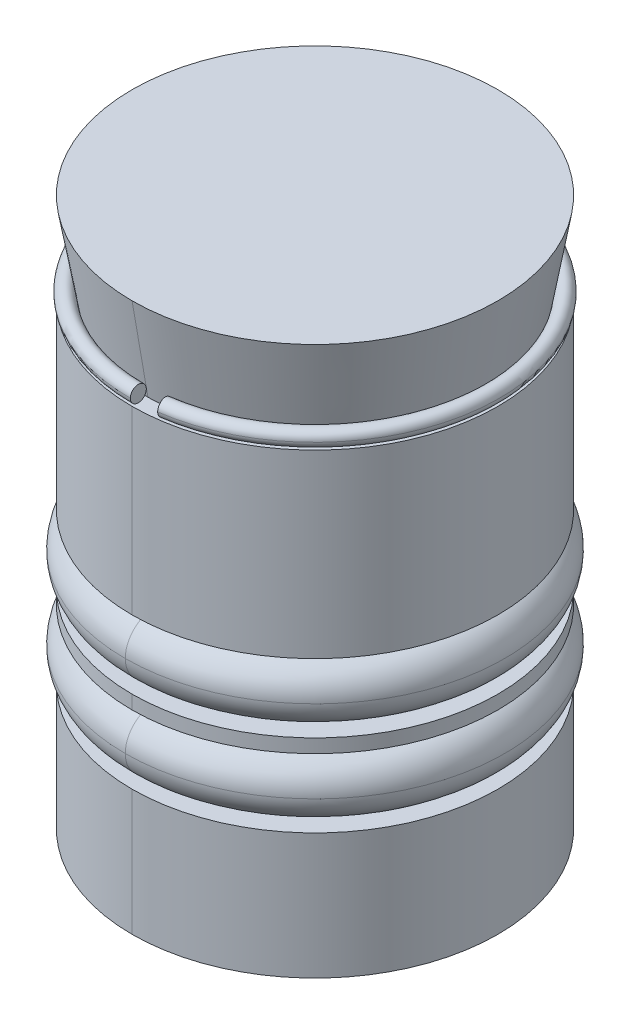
ISO-10303-21;
HEADER;
FILE_DESCRIPTION(('STEP AP214'),'2;1');
FILE_NAME('part.step','',(''),(''),'','','');
FILE_SCHEMA(('AUTOMOTIVE_DESIGN { 1 0 10303 214 1 1 1 1 }'));
ENDSEC;
DATA;
#1=APPLICATION_CONTEXT('core data for automotive mechanical design processes');
#2=APPLICATION_PROTOCOL_DEFINITION('international standard','automotive_design',2000,#1);
#3=PRODUCT_CONTEXT('',#1,'mechanical');
#4=PRODUCT('Part','Part','',(#3));
#5=PRODUCT_RELATED_PRODUCT_CATEGORY('part','',(#4));
#6=PRODUCT_DEFINITION_FORMATION('','',#4);
#7=PRODUCT_DEFINITION_CONTEXT('part definition',#1,'design');
#8=PRODUCT_DEFINITION('design','',#6,#7);
#9=PRODUCT_DEFINITION_SHAPE('','',#8);
#10=(LENGTH_UNIT() NAMED_UNIT(*) SI_UNIT(.MILLI.,.METRE.));
#11=(NAMED_UNIT(*) PLANE_ANGLE_UNIT() SI_UNIT($,.RADIAN.));
#12=(NAMED_UNIT(*) SI_UNIT($,.STERADIAN.) SOLID_ANGLE_UNIT());
#13=UNCERTAINTY_MEASURE_WITH_UNIT(LENGTH_MEASURE(1.E-05),#10,'distance_accuracy_value','');
#14=(GEOMETRIC_REPRESENTATION_CONTEXT(3) GLOBAL_UNCERTAINTY_ASSIGNED_CONTEXT((#13)) GLOBAL_UNIT_ASSIGNED_CONTEXT((#10,
#11,#12)) REPRESENTATION_CONTEXT('',''));
#15=CARTESIAN_POINT('',(0.,0.,0.));
#16=DIRECTION('',(0.,0.,1.));
#17=DIRECTION('',(1.,0.,0.));
#18=AXIS2_PLACEMENT_3D('',#15,#16,#17);
#19=CARTESIAN_POINT('',(0.,5.3,0.));
#20=DIRECTION('',(0.,1.,0.));
#21=DIRECTION('',(0.,0.,1.));
#22=AXIS2_PLACEMENT_3D('',#19,#20,#21);
#23=TOROIDAL_SURFACE('',#22,3.5,0.65);
#24=CARTESIAN_POINT('',(0.,5.3,0.));
#25=DIRECTION('',(0.,1.,0.));
#26=DIRECTION('',(0.,0.,1.));
#27=AXIS2_PLACEMENT_3D('',#24,#25,#26);
#28=CIRCLE('',#27,4.15);
#29=CARTESIAN_POINT('',(0.,5.3,-4.15));
#30=VERTEX_POINT('',#29);
#31=CARTESIAN_POINT('',(0.,5.3,4.15));
#32=VERTEX_POINT('',#31);
#33=EDGE_CURVE('P0_E68',#30,#32,#28,.T.);
#34=ORIENTED_EDGE('',*,*,#33,.F.);
#35=CARTESIAN_POINT('',(0.,5.3,-3.5));
#36=DIRECTION('',(1.,0.,0.));
#37=DIRECTION('',(0.,0.,-1.));
#38=AXIS2_PLACEMENT_3D('',#35,#36,#37);
#39=CIRCLE('',#38,0.65);
#40=CARTESIAN_POINT('',(0.,5.3,-2.85));
#41=VERTEX_POINT('',#40);
#42=EDGE_CURVE('P0_E11',#41,#30,#39,.T.);
#43=ORIENTED_EDGE('',*,*,#42,.F.);
#44=CARTESIAN_POINT('',(0.,5.3,0.));
#45=DIRECTION('',(0.,1.,0.));
#46=DIRECTION('',(0.,0.,1.));
#47=AXIS2_PLACEMENT_3D('',#44,#45,#46);
#48=CIRCLE('',#47,2.85);
#49=CARTESIAN_POINT('',(0.,5.3,2.85));
#50=VERTEX_POINT('',#49);
#51=EDGE_CURVE('P0_E67',#41,#50,#48,.T.);
#52=ORIENTED_EDGE('',*,*,#51,.T.);
#53=CARTESIAN_POINT('',(0.,5.3,3.5));
#54=DIRECTION('',(-1.,0.,0.));
#55=DIRECTION('',(0.,0.,1.));
#56=AXIS2_PLACEMENT_3D('',#53,#54,#55);
#57=CIRCLE('',#56,0.65);
#58=EDGE_CURVE('P0_E27',#50,#32,#57,.T.);
#59=ORIENTED_EDGE('',*,*,#58,.T.);
#60=EDGE_LOOP('',(#34,#43,#52,#59));
#61=FACE_BOUND('',#60,.T.);
#62=ADVANCED_FACE('P0_F16',(#61),#23,.T.);
#63=CARTESIAN_POINT('',(0.,5.3,0.));
#64=DIRECTION('',(0.,1.,0.));
#65=DIRECTION('',(0.,0.,1.));
#66=AXIS2_PLACEMENT_3D('',#63,#64,#65);
#67=TOROIDAL_SURFACE('',#66,3.5,0.65);
#68=CARTESIAN_POINT('',(0.,5.3,0.));
#69=DIRECTION('',(0.,1.,0.));
#70=DIRECTION('',(0.,0.,1.));
#71=AXIS2_PLACEMENT_3D('',#68,#69,#70);
#72=CIRCLE('',#71,4.15);
#73=EDGE_CURVE('P0_E52',#32,#30,#72,.T.);
#74=ORIENTED_EDGE('',*,*,#73,.F.);
#75=ORIENTED_EDGE('',*,*,#58,.F.);
#76=CARTESIAN_POINT('',(0.,5.3,0.));
#77=DIRECTION('',(0.,1.,0.));
#78=DIRECTION('',(0.,0.,1.));
#79=AXIS2_PLACEMENT_3D('',#76,#77,#78);
#80=CIRCLE('',#79,2.85);
#81=EDGE_CURVE('P0_E20',#50,#41,#80,.T.);
#82=ORIENTED_EDGE('',*,*,#81,.T.);
#83=ORIENTED_EDGE('',*,*,#42,.T.);
#84=EDGE_LOOP('',(#74,#75,#82,#83));
#85=FACE_BOUND('',#84,.T.);
#86=ADVANCED_FACE('P0_F51',(#85),#67,.T.);
#87=CARTESIAN_POINT('',(0.,5.3,0.));
#88=DIRECTION('',(0.,1.,0.));
#89=DIRECTION('',(0.,0.,1.));
#90=AXIS2_PLACEMENT_3D('',#87,#88,#89);
#91=TOROIDAL_SURFACE('',#90,3.5,0.65);
#92=CARTESIAN_POINT('',(0.,5.3,3.5));
#93=DIRECTION('',(-1.,0.,0.));
#94=DIRECTION('',(0.,0.,1.));
#95=AXIS2_PLACEMENT_3D('',#92,#93,#94);
#96=CIRCLE('',#95,0.65);
#97=EDGE_CURVE('P0_E64',#32,#50,#96,.T.);
#98=ORIENTED_EDGE('',*,*,#97,.F.);
#99=ORIENTED_EDGE('',*,*,#73,.T.);
#100=CARTESIAN_POINT('',(0.,5.3,-3.5));
#101=DIRECTION('',(1.,0.,0.));
#102=DIRECTION('',(0.,0.,-1.));
#103=AXIS2_PLACEMENT_3D('',#100,#101,#102);
#104=CIRCLE('',#103,0.65);
#105=EDGE_CURVE('P0_E62',#30,#41,#104,.T.);
#106=ORIENTED_EDGE('',*,*,#105,.T.);
#107=ORIENTED_EDGE('',*,*,#81,.F.);
#108=EDGE_LOOP('',(#98,#99,#106,#107));
#109=FACE_BOUND('',#108,.T.);
#110=ADVANCED_FACE('P0_F60',(#109),#91,.T.);
#111=CARTESIAN_POINT('',(0.,5.3,0.));
#112=DIRECTION('',(0.,1.,0.));
#113=DIRECTION('',(0.,0.,1.));
#114=AXIS2_PLACEMENT_3D('',#111,#112,#113);
#115=TOROIDAL_SURFACE('',#114,3.5,0.65);
#116=ORIENTED_EDGE('',*,*,#105,.F.);
#117=ORIENTED_EDGE('',*,*,#33,.T.);
#118=ORIENTED_EDGE('',*,*,#97,.T.);
#119=ORIENTED_EDGE('',*,*,#51,.F.);
#120=EDGE_LOOP('',(#116,#117,#118,#119));
#121=FACE_BOUND('',#120,.T.);
#122=ADVANCED_FACE('P0_F18',(#121),#115,.T.);
#123=CLOSED_SHELL('',(#62,#86,#110,#122));
#124=MANIFOLD_SOLID_BREP('P0_B1',#123);
#125=CARTESIAN_POINT('',(0.535424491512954,10.175,3.82690795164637));
#126=DIRECTION('',(0.990353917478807,0.,-0.138560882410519));
#127=DIRECTION('',(0.,-1.,0.));
#128=AXIS2_PLACEMENT_3D('',#125,#126,#127);
#129=PLANE('',#128);
#130=CARTESIAN_POINT('',(0.535424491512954,10.175,3.82690795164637));
#131=DIRECTION('',(0.990353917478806,0.,-0.138560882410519));
#132=DIRECTION('',(-0.138560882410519,0.,-0.990353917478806));
#133=AXIS2_PLACEMENT_3D('',#130,#131,#132);
#134=CIRCLE('',#133,0.175);
#135=CARTESIAN_POINT('',(0.511176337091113,10.175,3.65359601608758));
#136=VERTEX_POINT('',#135);
#137=CARTESIAN_POINT('',(0.559672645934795,10.175,4.00021988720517));
#138=VERTEX_POINT('',#137);
#139=EDGE_CURVE('P1_E66',#136,#138,#134,.T.);
#140=ORIENTED_EDGE('',*,*,#139,.F.);
#141=CARTESIAN_POINT('',(0.535424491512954,10.175,3.82690795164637));
#142=DIRECTION('',(0.990353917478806,0.,-0.138560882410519));
#143=DIRECTION('',(-0.138560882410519,0.,-0.990353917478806));
#144=AXIS2_PLACEMENT_3D('',#141,#142,#143);
#145=CIRCLE('',#144,0.175);
#146=EDGE_CURVE('P1_E26',#138,#136,#145,.T.);
#147=ORIENTED_EDGE('',*,*,#146,.F.);
#148=EDGE_LOOP('',(#140,#147));
#149=FACE_BOUND('',#148,.T.);
#150=ADVANCED_FACE('P1_F16',(#149),#129,.F.);
#151=CARTESIAN_POINT('',(0.,10.175,3.86418217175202));
#152=DIRECTION('',(1.,0.,0.));
#153=DIRECTION('',(0.,1.,0.));
#154=AXIS2_PLACEMENT_3D('',#151,#152,#153);
#155=PLANE('',#154);
#156=CARTESIAN_POINT('',(0.,10.175,3.86418217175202));
#157=DIRECTION('',(1.,0.,0.));
#158=DIRECTION('',(0.,0.,-1.));
#159=AXIS2_PLACEMENT_3D('',#156,#157,#158);
#160=CIRCLE('',#159,0.175);
#161=CARTESIAN_POINT('',(0.,10.175,3.68918217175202));
#162=VERTEX_POINT('',#161);
#163=CARTESIAN_POINT('',(0.,10.175,4.03918217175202));
#164=VERTEX_POINT('',#163);
#165=EDGE_CURVE('P1_E20',#162,#164,#160,.T.);
#166=ORIENTED_EDGE('',*,*,#165,.T.);
#167=CARTESIAN_POINT('',(0.,10.175,3.86418217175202));
#168=DIRECTION('',(1.,0.,0.));
#169=DIRECTION('',(0.,0.,-1.));
#170=AXIS2_PLACEMENT_3D('',#167,#168,#169);
#171=CIRCLE('',#170,0.175);
#172=EDGE_CURVE('P1_E11',#164,#162,#171,.T.);
#173=ORIENTED_EDGE('',*,*,#172,.T.);
#174=EDGE_LOOP('',(#166,#173));
#175=FACE_BOUND('',#174,.T.);
#176=ADVANCED_FACE('P1_F18',(#175),#155,.T.);
#177=CARTESIAN_POINT('',(0.,10.175,0.));
#178=DIRECTION('',(0.,1.,0.));
#179=DIRECTION('',(0.,0.,1.));
#180=AXIS2_PLACEMENT_3D('',#177,#178,#179);
#181=TOROIDAL_SURFACE('',#180,3.86418217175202,0.175);
#182=CARTESIAN_POINT('',(0.,10.175,0.));
#183=DIRECTION('',(0.,1.,0.));
#184=DIRECTION('',(0.,0.,1.));
#185=AXIS2_PLACEMENT_3D('',#182,#183,#184);
#186=CIRCLE('',#185,4.03918217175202);
#187=EDGE_CURVE('P1_E58',#138,#164,#186,.T.);
#188=ORIENTED_EDGE('',*,*,#187,.F.);
#189=ORIENTED_EDGE('',*,*,#146,.T.);
#190=CARTESIAN_POINT('',(0.,10.175,0.));
#191=DIRECTION('',(0.,1.,0.));
#192=DIRECTION('',(0.,0.,1.));
#193=AXIS2_PLACEMENT_3D('',#190,#191,#192);
#194=CIRCLE('',#193,3.68918217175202);
#195=EDGE_CURVE('P1_E55',#136,#162,#194,.T.);
#196=ORIENTED_EDGE('',*,*,#195,.T.);
#197=ORIENTED_EDGE('',*,*,#172,.F.);
#198=EDGE_LOOP('',(#188,#189,#196,#197));
#199=FACE_BOUND('',#198,.T.);
#200=ADVANCED_FACE('P1_F54',(#199),#181,.T.);
#201=CARTESIAN_POINT('',(0.,10.175,0.));
#202=DIRECTION('',(0.,1.,0.));
#203=DIRECTION('',(0.,0.,1.));
#204=AXIS2_PLACEMENT_3D('',#201,#202,#203);
#205=TOROIDAL_SURFACE('',#204,3.86418217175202,0.175);
#206=ORIENTED_EDGE('',*,*,#139,.T.);
#207=ORIENTED_EDGE('',*,*,#187,.T.);
#208=ORIENTED_EDGE('',*,*,#165,.F.);
#209=ORIENTED_EDGE('',*,*,#195,.F.);
#210=EDGE_LOOP('',(#206,#207,#208,#209));
#211=FACE_BOUND('',#210,.T.);
#212=ADVANCED_FACE('P1_F65',(#211),#205,.T.);
#213=CLOSED_SHELL('',(#150,#176,#200,#212));
#214=MANIFOLD_SOLID_BREP('P1_B1',#213);
#215=CARTESIAN_POINT('',(0.,12.,0.));
#216=DIRECTION('',(0.,-1.,0.));
#217=DIRECTION('',(0.,0.,-1.));
#218=AXIS2_PLACEMENT_3D('',#215,#216,#217);
#219=PLANE('',#218);
#220=CARTESIAN_POINT('',(0.,12.,0.));
#221=DIRECTION('',(0.,1.,0.));
#222=DIRECTION('',(0.,0.,1.));
#223=AXIS2_PLACEMENT_3D('',#220,#221,#222);
#224=CIRCLE('',#223,4.);
#225=CARTESIAN_POINT('',(0.,12.,4.));
#226=VERTEX_POINT('',#225);
#227=CARTESIAN_POINT('',(0.,12.,-4.));
#228=VERTEX_POINT('',#227);
#229=EDGE_CURVE('P2_E228',#226,#228,#224,.T.);
#230=ORIENTED_EDGE('',*,*,#229,.T.);
#231=CARTESIAN_POINT('',(0.,12.,0.));
#232=DIRECTION('',(0.,1.,0.));
#233=DIRECTION('',(0.,0.,1.));
#234=AXIS2_PLACEMENT_3D('',#231,#232,#233);
#235=CIRCLE('',#234,4.);
#236=EDGE_CURVE('P2_E11',#228,#226,#235,.T.);
#237=ORIENTED_EDGE('',*,*,#236,.T.);
#238=EDGE_LOOP('',(#230,#237));
#239=FACE_BOUND('',#238,.T.);
#240=ADVANCED_FACE('P2_F16',(#239),#219,.F.);
#241=CARTESIAN_POINT('',(0.,10.,0.));
#242=DIRECTION('',(0.,1.,0.));
#243=DIRECTION('',(0.,0.,1.));
#244=AXIS2_PLACEMENT_3D('',#241,#242,#243);
#245=CONICAL_SURFACE('',#244,3.65371595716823,0.171442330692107);
#246=DIRECTION('',(0.,0.985339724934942,-0.17060371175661));
#247=VECTOR('',#246,1.);
#248=CARTESIAN_POINT('',(0.,10.,-3.65371595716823));
#249=LINE('',#248,#247);
#250=CARTESIAN_POINT('',(0.,10.,-3.65371595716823));
#251=VERTEX_POINT('',#250);
#252=EDGE_CURVE('P2_E233',#251,#228,#249,.T.);
#253=ORIENTED_EDGE('',*,*,#252,.F.);
#254=CARTESIAN_POINT('',(0.,10.,0.));
#255=DIRECTION('',(0.,1.,0.));
#256=DIRECTION('',(0.,0.,1.));
#257=AXIS2_PLACEMENT_3D('',#254,#255,#256);
#258=CIRCLE('',#257,3.65371595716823);
#259=CARTESIAN_POINT('',(0.,10.,3.65371595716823));
#260=VERTEX_POINT('',#259);
#261=EDGE_CURVE('P2_E27',#251,#260,#258,.T.);
#262=ORIENTED_EDGE('',*,*,#261,.T.);
#263=DIRECTION('',(0.,0.985339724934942,0.17060371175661));
#264=VECTOR('',#263,1.);
#265=CARTESIAN_POINT('',(0.,10.,3.65371595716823));
#266=LINE('',#265,#264);
#267=EDGE_CURVE('P2_E224',#260,#226,#266,.T.);
#268=ORIENTED_EDGE('',*,*,#267,.T.);
#269=ORIENTED_EDGE('',*,*,#236,.F.);
#270=EDGE_LOOP('',(#253,#262,#268,#269));
#271=FACE_BOUND('',#270,.T.);
#272=ADVANCED_FACE('P2_F426',(#271),#245,.T.);
#273=CARTESIAN_POINT('',(0.,10.,-4.));
#274=DIRECTION('',(0.,-1.,0.));
#275=DIRECTION('',(0.,0.,-1.));
#276=AXIS2_PLACEMENT_3D('',#273,#274,#275);
#277=PLANE('',#276);
#278=CARTESIAN_POINT('',(0.,10.,0.));
#279=DIRECTION('',(0.,1.,0.));
#280=DIRECTION('',(0.,0.,1.));
#281=AXIS2_PLACEMENT_3D('',#278,#279,#280);
#282=CIRCLE('',#281,3.65371595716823);
#283=EDGE_CURVE('P2_E211',#260,#251,#282,.T.);
#284=ORIENTED_EDGE('',*,*,#283,.F.);
#285=ORIENTED_EDGE('',*,*,#261,.F.);
#286=EDGE_LOOP('',(#284,#285));
#287=FACE_BOUND('',#286,.T.);
#288=CARTESIAN_POINT('',(0.,10.,0.));
#289=DIRECTION('',(0.,1.,0.));
#290=DIRECTION('',(0.,0.,1.));
#291=AXIS2_PLACEMENT_3D('',#288,#289,#290);
#292=CIRCLE('',#291,4.);
#293=CARTESIAN_POINT('',(0.,10.,4.));
#294=VERTEX_POINT('',#293);
#295=CARTESIAN_POINT('',(0.,10.,-4.));
#296=VERTEX_POINT('',#295);
#297=EDGE_CURVE('P2_E277',#294,#296,#292,.T.);
#298=ORIENTED_EDGE('',*,*,#297,.T.);
#299=CARTESIAN_POINT('',(0.,10.,0.));
#300=DIRECTION('',(0.,1.,0.));
#301=DIRECTION('',(0.,0.,1.));
#302=AXIS2_PLACEMENT_3D('',#299,#300,#301);
#303=CIRCLE('',#302,4.);
#304=EDGE_CURVE('P2_E195',#296,#294,#303,.T.);
#305=ORIENTED_EDGE('',*,*,#304,.T.);
#306=EDGE_LOOP('',(#298,#305));
#307=FACE_BOUND('',#306,.T.);
#308=ADVANCED_FACE('P2_F431',(#287,#307),#277,.F.);
#309=CARTESIAN_POINT('',(0.,12.,0.));
#310=DIRECTION('',(0.,1.,0.));
#311=DIRECTION('',(0.,0.,1.));
#312=AXIS2_PLACEMENT_3D('',#309,#310,#311);
#313=CYLINDRICAL_SURFACE('',#312,4.);
#314=DIRECTION('',(0.,1.,0.));
#315=VECTOR('',#314,1.);
#316=CARTESIAN_POINT('',(0.,12.,-4.));
#317=LINE('',#316,#315);
#318=CARTESIAN_POINT('',(0.,6.05,-4.));
#319=VERTEX_POINT('',#318);
#320=EDGE_CURVE('P2_E269',#319,#296,#317,.T.);
#321=ORIENTED_EDGE('',*,*,#320,.F.);
#322=CARTESIAN_POINT('',(0.,6.05,0.));
#323=DIRECTION('',(0.,1.,0.));
#324=DIRECTION('',(0.,0.,1.));
#325=AXIS2_PLACEMENT_3D('',#322,#323,#324);
#326=CIRCLE('',#325,4.);
#327=CARTESIAN_POINT('',(0.,6.05,4.));
#328=VERTEX_POINT('',#327);
#329=EDGE_CURVE('P2_E197',#319,#328,#326,.T.);
#330=ORIENTED_EDGE('',*,*,#329,.T.);
#331=DIRECTION('',(0.,1.,0.));
#332=VECTOR('',#331,1.);
#333=CARTESIAN_POINT('',(0.,12.,4.));
#334=LINE('',#333,#332);
#335=EDGE_CURVE('P2_E280',#328,#294,#334,.T.);
#336=ORIENTED_EDGE('',*,*,#335,.T.);
#337=ORIENTED_EDGE('',*,*,#304,.F.);
#338=EDGE_LOOP('',(#321,#330,#336,#337));
#339=FACE_BOUND('',#338,.T.);
#340=ADVANCED_FACE('P2_F451',(#339),#313,.T.);
#341=CARTESIAN_POINT('',(0.,6.05,-3.5));
#342=DIRECTION('',(0.,1.,0.));
#343=DIRECTION('',(0.,0.,-1.));
#344=AXIS2_PLACEMENT_3D('',#341,#342,#343);
#345=PLANE('',#344);
#346=CARTESIAN_POINT('',(0.,6.05,0.));
#347=DIRECTION('',(0.,1.,0.));
#348=DIRECTION('',(0.,0.,1.));
#349=AXIS2_PLACEMENT_3D('',#346,#347,#348);
#350=CIRCLE('',#349,3.5);
#351=CARTESIAN_POINT('',(0.,6.05,3.5));
#352=VERTEX_POINT('',#351);
#353=CARTESIAN_POINT('',(0.,6.05,-3.5));
#354=VERTEX_POINT('',#353);
#355=EDGE_CURVE('P2_E190',#352,#354,#350,.T.);
#356=ORIENTED_EDGE('',*,*,#355,.T.);
#357=CARTESIAN_POINT('',(0.,6.05,0.));
#358=DIRECTION('',(0.,1.,0.));
#359=DIRECTION('',(0.,0.,1.));
#360=AXIS2_PLACEMENT_3D('',#357,#358,#359);
#361=CIRCLE('',#360,3.5);
#362=EDGE_CURVE('P2_E208',#354,#352,#361,.T.);
#363=ORIENTED_EDGE('',*,*,#362,.T.);
#364=EDGE_LOOP('',(#356,#363));
#365=FACE_BOUND('',#364,.T.);
#366=CARTESIAN_POINT('',(0.,6.05,0.));
#367=DIRECTION('',(0.,1.,0.));
#368=DIRECTION('',(0.,0.,1.));
#369=AXIS2_PLACEMENT_3D('',#366,#367,#368);
#370=CIRCLE('',#369,4.);
#371=EDGE_CURVE('P2_E227',#328,#319,#370,.T.);
#372=ORIENTED_EDGE('',*,*,#371,.F.);
#373=ORIENTED_EDGE('',*,*,#329,.F.);
#374=EDGE_LOOP('',(#372,#373));
#375=FACE_BOUND('',#374,.T.);
#376=ADVANCED_FACE('P2_F456',(#365,#375),#345,.F.);
#377=CARTESIAN_POINT('',(0.,5.3,0.));
#378=DIRECTION('',(0.,1.,0.));
#379=DIRECTION('',(0.,0.,1.));
#380=AXIS2_PLACEMENT_3D('',#377,#378,#379);
#381=TOROIDAL_SURFACE('',#380,3.5,0.75);
#382=CARTESIAN_POINT('',(0.,5.3,0.));
#383=DIRECTION('',(0.,1.,0.));
#384=DIRECTION('',(0.,0.,1.));
#385=AXIS2_PLACEMENT_3D('',#382,#383,#384);
#386=CIRCLE('',#385,2.75);
#387=CARTESIAN_POINT('',(0.,5.3,2.75));
#388=VERTEX_POINT('',#387);
#389=CARTESIAN_POINT('',(0.,5.3,-2.75));
#390=VERTEX_POINT('',#389);
#391=EDGE_CURVE('P2_E198',#388,#390,#386,.T.);
#392=ORIENTED_EDGE('',*,*,#391,.F.);
#393=CARTESIAN_POINT('',(0.,5.3,3.5));
#394=DIRECTION('',(-1.,0.,0.));
#395=DIRECTION('',(0.,0.,1.));
#396=AXIS2_PLACEMENT_3D('',#393,#394,#395);
#397=CIRCLE('',#396,0.75);
#398=CARTESIAN_POINT('',(0.,4.55,3.5));
#399=VERTEX_POINT('',#398);
#400=EDGE_CURVE('P2_E258',#388,#399,#397,.T.);
#401=ORIENTED_EDGE('',*,*,#400,.T.);
#402=CARTESIAN_POINT('',(0.,4.55,0.));
#403=DIRECTION('',(0.,1.,0.));
#404=DIRECTION('',(0.,0.,1.));
#405=AXIS2_PLACEMENT_3D('',#402,#403,#404);
#406=CIRCLE('',#405,3.5);
#407=CARTESIAN_POINT('',(0.,4.55,-3.5));
#408=VERTEX_POINT('',#407);
#409=EDGE_CURVE('P2_E273',#399,#408,#406,.T.);
#410=ORIENTED_EDGE('',*,*,#409,.T.);
#411=CARTESIAN_POINT('',(0.,5.3,-3.5));
#412=DIRECTION('',(1.,0.,0.));
#413=DIRECTION('',(0.,0.,-1.));
#414=AXIS2_PLACEMENT_3D('',#411,#412,#413);
#415=CIRCLE('',#414,0.75);
#416=EDGE_CURVE('P2_E295',#390,#408,#415,.T.);
#417=ORIENTED_EDGE('',*,*,#416,.F.);
#418=EDGE_LOOP('',(#392,#401,#410,#417));
#419=FACE_BOUND('',#418,.T.);
#420=ADVANCED_FACE('P2_F416',(#419),#381,.F.);
#421=CARTESIAN_POINT('',(0.,4.55,-3.5));
#422=DIRECTION('',(0.,-1.,0.));
#423=DIRECTION('',(0.,0.,-1.));
#424=AXIS2_PLACEMENT_3D('',#421,#422,#423);
#425=PLANE('',#424);
#426=ORIENTED_EDGE('',*,*,#409,.F.);
#427=CARTESIAN_POINT('',(0.,4.55,0.));
#428=DIRECTION('',(0.,1.,0.));
#429=DIRECTION('',(0.,0.,1.));
#430=AXIS2_PLACEMENT_3D('',#427,#428,#429);
#431=CIRCLE('',#430,3.5);
#432=EDGE_CURVE('P2_E262',#408,#399,#431,.T.);
#433=ORIENTED_EDGE('',*,*,#432,.F.);
#434=EDGE_LOOP('',(#426,#433));
#435=FACE_BOUND('',#434,.T.);
#436=CARTESIAN_POINT('',(0.,4.55,0.));
#437=DIRECTION('',(0.,1.,0.));
#438=DIRECTION('',(0.,0.,1.));
#439=AXIS2_PLACEMENT_3D('',#436,#437,#438);
#440=CIRCLE('',#439,4.);
#441=CARTESIAN_POINT('',(0.,4.55,4.));
#442=VERTEX_POINT('',#441);
#443=CARTESIAN_POINT('',(0.,4.55,-4.));
#444=VERTEX_POINT('',#443);
#445=EDGE_CURVE('P2_E212',#442,#444,#440,.T.);
#446=ORIENTED_EDGE('',*,*,#445,.T.);
#447=CARTESIAN_POINT('',(0.,4.55,0.));
#448=DIRECTION('',(0.,1.,0.));
#449=DIRECTION('',(0.,0.,1.));
#450=AXIS2_PLACEMENT_3D('',#447,#448,#449);
#451=CIRCLE('',#450,4.);
#452=EDGE_CURVE('P2_E20',#444,#442,#451,.T.);
#453=ORIENTED_EDGE('',*,*,#452,.T.);
#454=EDGE_LOOP('',(#446,#453));
#455=FACE_BOUND('',#454,.T.);
#456=ADVANCED_FACE('P2_F410',(#435,#455),#425,.F.);
#457=CARTESIAN_POINT('',(0.,12.,0.));
#458=DIRECTION('',(0.,1.,0.));
#459=DIRECTION('',(0.,0.,1.));
#460=AXIS2_PLACEMENT_3D('',#457,#458,#459);
#461=CYLINDRICAL_SURFACE('',#460,4.);
#462=DIRECTION('',(0.,1.,0.));
#463=VECTOR('',#462,1.);
#464=CARTESIAN_POINT('',(0.,12.,-4.));
#465=LINE('',#464,#463);
#466=CARTESIAN_POINT('',(0.,4.25,-4.));
#467=VERTEX_POINT('',#466);
#468=EDGE_CURVE('P2_E216',#467,#444,#465,.T.);
#469=ORIENTED_EDGE('',*,*,#468,.F.);
#470=CARTESIAN_POINT('',(0.,4.25,0.));
#471=DIRECTION('',(0.,1.,0.));
#472=DIRECTION('',(0.,0.,1.));
#473=AXIS2_PLACEMENT_3D('',#470,#471,#472);
#474=CIRCLE('',#473,4.);
#475=CARTESIAN_POINT('',(0.,4.25,4.));
#476=VERTEX_POINT('',#475);
#477=EDGE_CURVE('P2_E274',#467,#476,#474,.T.);
#478=ORIENTED_EDGE('',*,*,#477,.T.);
#479=DIRECTION('',(0.,1.,0.));
#480=VECTOR('',#479,1.);
#481=CARTESIAN_POINT('',(0.,12.,4.));
#482=LINE('',#481,#480);
#483=EDGE_CURVE('P2_E161',#476,#442,#482,.T.);
#484=ORIENTED_EDGE('',*,*,#483,.T.);
#485=ORIENTED_EDGE('',*,*,#452,.F.);
#486=EDGE_LOOP('',(#469,#478,#484,#485));
#487=FACE_BOUND('',#486,.T.);
#488=ADVANCED_FACE('P2_F415',(#487),#461,.T.);
#489=CARTESIAN_POINT('',(0.,4.25,-3.5));
#490=DIRECTION('',(0.,1.,0.));
#491=DIRECTION('',(0.,0.,-1.));
#492=AXIS2_PLACEMENT_3D('',#489,#490,#491);
#493=PLANE('',#492);
#494=CARTESIAN_POINT('',(0.,4.25,0.));
#495=DIRECTION('',(0.,1.,0.));
#496=DIRECTION('',(0.,0.,1.));
#497=AXIS2_PLACEMENT_3D('',#494,#495,#496);
#498=CIRCLE('',#497,3.5);
#499=CARTESIAN_POINT('',(0.,4.25,3.5));
#500=VERTEX_POINT('',#499);
#501=CARTESIAN_POINT('',(0.,4.25,-3.5));
#502=VERTEX_POINT('',#501);
#503=EDGE_CURVE('P2_E172',#500,#502,#498,.T.);
#504=ORIENTED_EDGE('',*,*,#503,.T.);
#505=CARTESIAN_POINT('',(0.,4.25,0.));
#506=DIRECTION('',(0.,1.,0.));
#507=DIRECTION('',(0.,0.,1.));
#508=AXIS2_PLACEMENT_3D('',#505,#506,#507);
#509=CIRCLE('',#508,3.5);
#510=EDGE_CURVE('P2_E171',#502,#500,#509,.T.);
#511=ORIENTED_EDGE('',*,*,#510,.T.);
#512=EDGE_LOOP('',(#504,#511));
#513=FACE_BOUND('',#512,.T.);
#514=CARTESIAN_POINT('',(0.,4.25,0.));
#515=DIRECTION('',(0.,1.,0.));
#516=DIRECTION('',(0.,0.,1.));
#517=AXIS2_PLACEMENT_3D('',#514,#515,#516);
#518=CIRCLE('',#517,4.);
#519=EDGE_CURVE('P2_E194',#476,#467,#518,.T.);
#520=ORIENTED_EDGE('',*,*,#519,.F.);
#521=ORIENTED_EDGE('',*,*,#477,.F.);
#522=EDGE_LOOP('',(#520,#521));
#523=FACE_BOUND('',#522,.T.);
#524=ADVANCED_FACE('P2_F362',(#513,#523),#493,.F.);
#525=CARTESIAN_POINT('',(0.,3.5,0.));
#526=DIRECTION('',(0.,1.,0.));
#527=DIRECTION('',(0.,0.,1.));
#528=AXIS2_PLACEMENT_3D('',#525,#526,#527);
#529=TOROIDAL_SURFACE('',#528,3.5,0.75);
#530=CARTESIAN_POINT('',(0.,3.5,0.));
#531=DIRECTION('',(0.,1.,0.));
#532=DIRECTION('',(0.,0.,1.));
#533=AXIS2_PLACEMENT_3D('',#530,#531,#532);
#534=CIRCLE('',#533,2.75);
#535=CARTESIAN_POINT('',(0.,3.5,2.75));
#536=VERTEX_POINT('',#535);
#537=CARTESIAN_POINT('',(0.,3.5,-2.75));
#538=VERTEX_POINT('',#537);
#539=EDGE_CURVE('P2_E153',#536,#538,#534,.T.);
#540=ORIENTED_EDGE('',*,*,#539,.F.);
#541=CARTESIAN_POINT('',(0.,3.5,3.5));
#542=DIRECTION('',(-1.,0.,0.));
#543=DIRECTION('',(0.,0.,1.));
#544=AXIS2_PLACEMENT_3D('',#541,#542,#543);
#545=CIRCLE('',#544,0.75);
#546=CARTESIAN_POINT('',(0.,2.75,3.5));
#547=VERTEX_POINT('',#546);
#548=EDGE_CURVE('P2_E167',#536,#547,#545,.T.);
#549=ORIENTED_EDGE('',*,*,#548,.T.);
#550=CARTESIAN_POINT('',(0.,2.75,0.));
#551=DIRECTION('',(0.,1.,0.));
#552=DIRECTION('',(0.,0.,1.));
#553=AXIS2_PLACEMENT_3D('',#550,#551,#552);
#554=CIRCLE('',#553,3.5);
#555=CARTESIAN_POINT('',(0.,2.75,-3.5));
#556=VERTEX_POINT('',#555);
#557=EDGE_CURVE('P2_E155',#547,#556,#554,.T.);
#558=ORIENTED_EDGE('',*,*,#557,.T.);
#559=CARTESIAN_POINT('',(0.,3.5,-3.5));
#560=DIRECTION('',(1.,0.,0.));
#561=DIRECTION('',(0.,0.,-1.));
#562=AXIS2_PLACEMENT_3D('',#559,#560,#561);
#563=CIRCLE('',#562,0.75);
#564=EDGE_CURVE('P2_E148',#538,#556,#563,.T.);
#565=ORIENTED_EDGE('',*,*,#564,.F.);
#566=EDGE_LOOP('',(#540,#549,#558,#565));
#567=FACE_BOUND('',#566,.T.);
#568=ADVANCED_FACE('P2_F150',(#567),#529,.F.);
#569=CARTESIAN_POINT('',(0.,2.75,-3.5));
#570=DIRECTION('',(0.,-1.,0.));
#571=DIRECTION('',(0.,0.,-1.));
#572=AXIS2_PLACEMENT_3D('',#569,#570,#571);
#573=PLANE('',#572);
#574=ORIENTED_EDGE('',*,*,#557,.F.);
#575=CARTESIAN_POINT('',(0.,2.75,0.));
#576=DIRECTION('',(0.,1.,0.));
#577=DIRECTION('',(0.,0.,1.));
#578=AXIS2_PLACEMENT_3D('',#575,#576,#577);
#579=CIRCLE('',#578,3.5);
#580=EDGE_CURVE('P2_E160',#556,#547,#579,.T.);
#581=ORIENTED_EDGE('',*,*,#580,.F.);
#582=EDGE_LOOP('',(#574,#581));
#583=FACE_BOUND('',#582,.T.);
#584=CARTESIAN_POINT('',(0.,2.75,0.));
#585=DIRECTION('',(0.,1.,0.));
#586=DIRECTION('',(0.,0.,1.));
#587=AXIS2_PLACEMENT_3D('',#584,#585,#586);
#588=CIRCLE('',#587,4.);
#589=CARTESIAN_POINT('',(0.,2.75,4.));
#590=VERTEX_POINT('',#589);
#591=CARTESIAN_POINT('',(0.,2.75,-4.));
#592=VERTEX_POINT('',#591);
#593=EDGE_CURVE('P2_E219',#590,#592,#588,.T.);
#594=ORIENTED_EDGE('',*,*,#593,.T.);
#595=CARTESIAN_POINT('',(0.,2.75,0.));
#596=DIRECTION('',(0.,1.,0.));
#597=DIRECTION('',(0.,0.,1.));
#598=AXIS2_PLACEMENT_3D('',#595,#596,#597);
#599=CIRCLE('',#598,4.);
#600=EDGE_CURVE('P2_E40',#592,#590,#599,.T.);
#601=ORIENTED_EDGE('',*,*,#600,.T.);
#602=EDGE_LOOP('',(#594,#601));
#603=FACE_BOUND('',#602,.T.);
#604=ADVANCED_FACE('P2_F361',(#583,#603),#573,.F.);
#605=CARTESIAN_POINT('',(0.,12.,0.));
#606=DIRECTION('',(0.,1.,0.));
#607=DIRECTION('',(0.,0.,1.));
#608=AXIS2_PLACEMENT_3D('',#605,#606,#607);
#609=CYLINDRICAL_SURFACE('',#608,4.);
#610=DIRECTION('',(0.,1.,0.));
#611=VECTOR('',#610,1.);
#612=CARTESIAN_POINT('',(0.,12.,-4.));
#613=LINE('',#612,#611);
#614=CARTESIAN_POINT('',(0.,0.,-4.));
#615=VERTEX_POINT('',#614);
#616=EDGE_CURVE('P2_E223',#615,#592,#613,.T.);
#617=ORIENTED_EDGE('',*,*,#616,.F.);
#618=CARTESIAN_POINT('',(0.,0.,0.));
#619=DIRECTION('',(0.,1.,0.));
#620=DIRECTION('',(0.,0.,1.));
#621=AXIS2_PLACEMENT_3D('',#618,#619,#620);
#622=CIRCLE('',#621,4.);
#623=CARTESIAN_POINT('',(0.,0.,4.));
#624=VERTEX_POINT('',#623);
#625=EDGE_CURVE('P2_E244',#615,#624,#622,.T.);
#626=ORIENTED_EDGE('',*,*,#625,.T.);
#627=DIRECTION('',(0.,1.,0.));
#628=VECTOR('',#627,1.);
#629=CARTESIAN_POINT('',(0.,12.,4.));
#630=LINE('',#629,#628);
#631=EDGE_CURVE('P2_E222',#624,#590,#630,.T.);
#632=ORIENTED_EDGE('',*,*,#631,.T.);
#633=ORIENTED_EDGE('',*,*,#600,.F.);
#634=EDGE_LOOP('',(#617,#626,#632,#633));
#635=FACE_BOUND('',#634,.T.);
#636=ADVANCED_FACE('P2_F390',(#635),#609,.T.);
#637=CARTESIAN_POINT('',(0.,0.,-4.));
#638=DIRECTION('',(0.,1.,0.));
#639=DIRECTION('',(0.,0.,-1.));
#640=AXIS2_PLACEMENT_3D('',#637,#638,#639);
#641=PLANE('',#640);
#642=CARTESIAN_POINT('',(0.,0.,0.));
#643=DIRECTION('',(0.,1.,0.));
#644=DIRECTION('',(0.,0.,1.));
#645=AXIS2_PLACEMENT_3D('',#642,#643,#644);
#646=CIRCLE('',#645,4.);
#647=EDGE_CURVE('P2_E237',#624,#615,#646,.T.);
#648=ORIENTED_EDGE('',*,*,#647,.F.);
#649=ORIENTED_EDGE('',*,*,#625,.F.);
#650=EDGE_LOOP('',(#648,#649));
#651=FACE_BOUND('',#650,.T.);
#652=ADVANCED_FACE('P2_F384',(#651),#641,.F.);
#653=CARTESIAN_POINT('',(0.,12.,0.));
#654=DIRECTION('',(0.,1.,0.));
#655=DIRECTION('',(0.,0.,1.));
#656=AXIS2_PLACEMENT_3D('',#653,#654,#655);
#657=CYLINDRICAL_SURFACE('',#656,4.);
#658=ORIENTED_EDGE('',*,*,#647,.T.);
#659=ORIENTED_EDGE('',*,*,#616,.T.);
#660=ORIENTED_EDGE('',*,*,#593,.F.);
#661=ORIENTED_EDGE('',*,*,#631,.F.);
#662=EDGE_LOOP('',(#658,#659,#660,#661));
#663=FACE_BOUND('',#662,.T.);
#664=ADVANCED_FACE('P2_F389',(#663),#657,.T.);
#665=CARTESIAN_POINT('',(0.,3.5,0.));
#666=DIRECTION('',(0.,1.,0.));
#667=DIRECTION('',(0.,0.,1.));
#668=AXIS2_PLACEMENT_3D('',#665,#666,#667);
#669=TOROIDAL_SURFACE('',#668,3.5,0.75);
#670=CARTESIAN_POINT('',(0.,3.5,0.));
#671=DIRECTION('',(0.,1.,0.));
#672=DIRECTION('',(0.,0.,1.));
#673=AXIS2_PLACEMENT_3D('',#670,#671,#672);
#674=CIRCLE('',#673,2.75);
#675=EDGE_CURVE('P2_E164',#538,#536,#674,.T.);
#676=ORIENTED_EDGE('',*,*,#675,.F.);
#677=ORIENTED_EDGE('',*,*,#564,.T.);
#678=ORIENTED_EDGE('',*,*,#580,.T.);
#679=ORIENTED_EDGE('',*,*,#548,.F.);
#680=EDGE_LOOP('',(#676,#677,#678,#679));
#681=FACE_BOUND('',#680,.T.);
#682=ADVANCED_FACE('P2_F166',(#681),#669,.F.);
#683=CARTESIAN_POINT('',(0.,12.,0.));
#684=DIRECTION('',(0.,1.,0.));
#685=DIRECTION('',(0.,0.,1.));
#686=AXIS2_PLACEMENT_3D('',#683,#684,#685);
#687=CYLINDRICAL_SURFACE('',#686,4.);
#688=ORIENTED_EDGE('',*,*,#519,.T.);
#689=ORIENTED_EDGE('',*,*,#468,.T.);
#690=ORIENTED_EDGE('',*,*,#445,.F.);
#691=ORIENTED_EDGE('',*,*,#483,.F.);
#692=EDGE_LOOP('',(#688,#689,#690,#691));
#693=FACE_BOUND('',#692,.T.);
#694=ADVANCED_FACE('P2_F371',(#693),#687,.T.);
#695=CARTESIAN_POINT('',(0.,5.3,0.));
#696=DIRECTION('',(0.,1.,0.));
#697=DIRECTION('',(0.,0.,1.));
#698=AXIS2_PLACEMENT_3D('',#695,#696,#697);
#699=TOROIDAL_SURFACE('',#698,3.5,0.75);
#700=CARTESIAN_POINT('',(0.,5.3,0.));
#701=DIRECTION('',(0.,1.,0.));
#702=DIRECTION('',(0.,0.,1.));
#703=AXIS2_PLACEMENT_3D('',#700,#701,#702);
#704=CIRCLE('',#703,2.75);
#705=EDGE_CURVE('P2_E204',#390,#388,#704,.T.);
#706=ORIENTED_EDGE('',*,*,#705,.F.);
#707=ORIENTED_EDGE('',*,*,#416,.T.);
#708=ORIENTED_EDGE('',*,*,#432,.T.);
#709=ORIENTED_EDGE('',*,*,#400,.F.);
#710=EDGE_LOOP('',(#706,#707,#708,#709));
#711=FACE_BOUND('',#710,.T.);
#712=ADVANCED_FACE('P2_F348',(#711),#699,.F.);
#713=CARTESIAN_POINT('',(0.,12.,0.));
#714=DIRECTION('',(0.,1.,0.));
#715=DIRECTION('',(0.,0.,1.));
#716=AXIS2_PLACEMENT_3D('',#713,#714,#715);
#717=CYLINDRICAL_SURFACE('',#716,4.);
#718=ORIENTED_EDGE('',*,*,#371,.T.);
#719=ORIENTED_EDGE('',*,*,#320,.T.);
#720=ORIENTED_EDGE('',*,*,#297,.F.);
#721=ORIENTED_EDGE('',*,*,#335,.F.);
#722=EDGE_LOOP('',(#718,#719,#720,#721));
#723=FACE_BOUND('',#722,.T.);
#724=ADVANCED_FACE('P2_F343',(#723),#717,.T.);
#725=CARTESIAN_POINT('',(0.,10.,0.));
#726=DIRECTION('',(0.,1.,0.));
#727=DIRECTION('',(0.,0.,1.));
#728=AXIS2_PLACEMENT_3D('',#725,#726,#727);
#729=CONICAL_SURFACE('',#728,3.65371595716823,0.171442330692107);
#730=ORIENTED_EDGE('',*,*,#283,.T.);
#731=ORIENTED_EDGE('',*,*,#252,.T.);
#732=ORIENTED_EDGE('',*,*,#229,.F.);
#733=ORIENTED_EDGE('',*,*,#267,.F.);
#734=EDGE_LOOP('',(#730,#731,#732,#733));
#735=FACE_BOUND('',#734,.T.);
#736=ADVANCED_FACE('P2_F332',(#735),#729,.T.);
#737=CARTESIAN_POINT('',(0.,5.3,0.));
#738=DIRECTION('',(0.,1.,0.));
#739=DIRECTION('',(0.,0.,1.));
#740=AXIS2_PLACEMENT_3D('',#737,#738,#739);
#741=TOROIDAL_SURFACE('',#740,3.5,0.75);
#742=CARTESIAN_POINT('',(0.,5.3,-3.5));
#743=DIRECTION('',(1.,0.,0.));
#744=DIRECTION('',(0.,0.,-1.));
#745=AXIS2_PLACEMENT_3D('',#742,#743,#744);
#746=CIRCLE('',#745,0.75);
#747=EDGE_CURVE('P2_E202',#354,#390,#746,.T.);
#748=ORIENTED_EDGE('',*,*,#747,.T.);
#749=ORIENTED_EDGE('',*,*,#705,.T.);
#750=CARTESIAN_POINT('',(0.,5.3,3.5));
#751=DIRECTION('',(-1.,0.,0.));
#752=DIRECTION('',(0.,0.,1.));
#753=AXIS2_PLACEMENT_3D('',#750,#751,#752);
#754=CIRCLE('',#753,0.75);
#755=EDGE_CURVE('P2_E203',#352,#388,#754,.T.);
#756=ORIENTED_EDGE('',*,*,#755,.F.);
#757=ORIENTED_EDGE('',*,*,#362,.F.);
#758=EDGE_LOOP('',(#748,#749,#756,#757));
#759=FACE_BOUND('',#758,.T.);
#760=ADVANCED_FACE('P2_F327',(#759),#741,.F.);
#761=CARTESIAN_POINT('',(0.,3.5,0.));
#762=DIRECTION('',(0.,1.,0.));
#763=DIRECTION('',(0.,0.,1.));
#764=AXIS2_PLACEMENT_3D('',#761,#762,#763);
#765=TOROIDAL_SURFACE('',#764,3.5,0.75);
#766=CARTESIAN_POINT('',(0.,3.5,-3.5));
#767=DIRECTION('',(1.,0.,0.));
#768=DIRECTION('',(0.,0.,-1.));
#769=AXIS2_PLACEMENT_3D('',#766,#767,#768);
#770=CIRCLE('',#769,0.75);
#771=EDGE_CURVE('P2_E175',#502,#538,#770,.T.);
#772=ORIENTED_EDGE('',*,*,#771,.T.);
#773=ORIENTED_EDGE('',*,*,#675,.T.);
#774=CARTESIAN_POINT('',(0.,3.5,3.5));
#775=DIRECTION('',(-1.,0.,0.));
#776=DIRECTION('',(0.,0.,1.));
#777=AXIS2_PLACEMENT_3D('',#774,#775,#776);
#778=CIRCLE('',#777,0.75);
#779=EDGE_CURVE('P2_E182',#500,#536,#778,.T.);
#780=ORIENTED_EDGE('',*,*,#779,.F.);
#781=ORIENTED_EDGE('',*,*,#510,.F.);
#782=EDGE_LOOP('',(#772,#773,#780,#781));
#783=FACE_BOUND('',#782,.T.);
#784=ADVANCED_FACE('P2_F18',(#783),#765,.F.);
#785=CARTESIAN_POINT('',(0.,3.5,0.));
#786=DIRECTION('',(0.,1.,0.));
#787=DIRECTION('',(0.,0.,1.));
#788=AXIS2_PLACEMENT_3D('',#785,#786,#787);
#789=TOROIDAL_SURFACE('',#788,3.5,0.75);
#790=ORIENTED_EDGE('',*,*,#779,.T.);
#791=ORIENTED_EDGE('',*,*,#539,.T.);
#792=ORIENTED_EDGE('',*,*,#771,.F.);
#793=ORIENTED_EDGE('',*,*,#503,.F.);
#794=EDGE_LOOP('',(#790,#791,#792,#793));
#795=FACE_BOUND('',#794,.T.);
#796=ADVANCED_FACE('P2_F181',(#795),#789,.F.);
#797=CARTESIAN_POINT('',(0.,5.3,0.));
#798=DIRECTION('',(0.,1.,0.));
#799=DIRECTION('',(0.,0.,1.));
#800=AXIS2_PLACEMENT_3D('',#797,#798,#799);
#801=TOROIDAL_SURFACE('',#800,3.5,0.75);
#802=ORIENTED_EDGE('',*,*,#755,.T.);
#803=ORIENTED_EDGE('',*,*,#391,.T.);
#804=ORIENTED_EDGE('',*,*,#747,.F.);
#805=ORIENTED_EDGE('',*,*,#355,.F.);
#806=EDGE_LOOP('',(#802,#803,#804,#805));
#807=FACE_BOUND('',#806,.T.);
#808=ADVANCED_FACE('P2_F554',(#807),#801,.F.);
#809=CLOSED_SHELL('',(#240,#272,#308,#340,#376,#420,#456,#488,#524,#568,#604,#636,#652,#664,
#682,#694,#712,#724,#736,#760,#784,#796,#808));
#810=MANIFOLD_SOLID_BREP('P2_B1',#809);
#811=CARTESIAN_POINT('',(0.,3.5,0.));
#812=DIRECTION('',(0.,1.,0.));
#813=DIRECTION('',(0.,0.,1.));
#814=AXIS2_PLACEMENT_3D('',#811,#812,#813);
#815=TOROIDAL_SURFACE('',#814,3.5,0.65);
#816=CARTESIAN_POINT('',(0.,3.5,0.));
#817=DIRECTION('',(0.,1.,0.));
#818=DIRECTION('',(0.,0.,1.));
#819=AXIS2_PLACEMENT_3D('',#816,#817,#818);
#820=CIRCLE('',#819,4.15);
#821=CARTESIAN_POINT('',(0.,3.5,-4.15));
#822=VERTEX_POINT('',#821);
#823=CARTESIAN_POINT('',(0.,3.5,4.15));
#824=VERTEX_POINT('',#823);
#825=EDGE_CURVE('P3_E69',#822,#824,#820,.T.);
#826=ORIENTED_EDGE('',*,*,#825,.F.);
#827=CARTESIAN_POINT('',(0.,3.5,-3.5));
#828=DIRECTION('',(1.,0.,0.));
#829=DIRECTION('',(0.,0.,-1.));
#830=AXIS2_PLACEMENT_3D('',#827,#828,#829);
#831=CIRCLE('',#830,0.65);
#832=CARTESIAN_POINT('',(0.,3.5,-2.85));
#833=VERTEX_POINT('',#832);
#834=EDGE_CURVE('P3_E10',#833,#822,#831,.T.);
#835=ORIENTED_EDGE('',*,*,#834,.F.);
#836=CARTESIAN_POINT('',(0.,3.5,0.));
#837=DIRECTION('',(0.,1.,0.));
#838=DIRECTION('',(0.,0.,1.));
#839=AXIS2_PLACEMENT_3D('',#836,#837,#838);
#840=CIRCLE('',#839,2.85);
#841=CARTESIAN_POINT('',(0.,3.5,2.85));
#842=VERTEX_POINT('',#841);
#843=EDGE_CURVE('P3_E68',#833,#842,#840,.T.);
#844=ORIENTED_EDGE('',*,*,#843,.T.);
#845=CARTESIAN_POINT('',(0.,3.5,3.5));
#846=DIRECTION('',(-1.,0.,0.));
#847=DIRECTION('',(0.,0.,1.));
#848=AXIS2_PLACEMENT_3D('',#845,#846,#847);
#849=CIRCLE('',#848,0.65);
#850=EDGE_CURVE('P3_E25',#842,#824,#849,.T.);
#851=ORIENTED_EDGE('',*,*,#850,.T.);
#852=EDGE_LOOP('',(#826,#835,#844,#851));
#853=FACE_BOUND('',#852,.T.);
#854=ADVANCED_FACE('P3_F15',(#853),#815,.T.);
#855=CARTESIAN_POINT('',(0.,3.5,0.));
#856=DIRECTION('',(0.,1.,0.));
#857=DIRECTION('',(0.,0.,1.));
#858=AXIS2_PLACEMENT_3D('',#855,#856,#857);
#859=TOROIDAL_SURFACE('',#858,3.5,0.65);
#860=CARTESIAN_POINT('',(0.,3.5,0.));
#861=DIRECTION('',(0.,1.,0.));
#862=DIRECTION('',(0.,0.,1.));
#863=AXIS2_PLACEMENT_3D('',#860,#861,#862);
#864=CIRCLE('',#863,4.15);
#865=EDGE_CURVE('P3_E19',#824,#822,#864,.T.);
#866=ORIENTED_EDGE('',*,*,#865,.F.);
#867=ORIENTED_EDGE('',*,*,#850,.F.);
#868=CARTESIAN_POINT('',(0.,3.5,0.));
#869=DIRECTION('',(0.,1.,0.));
#870=DIRECTION('',(0.,0.,1.));
#871=AXIS2_PLACEMENT_3D('',#868,#869,#870);
#872=CIRCLE('',#871,2.85);
#873=EDGE_CURVE('P3_E58',#842,#833,#872,.T.);
#874=ORIENTED_EDGE('',*,*,#873,.T.);
#875=ORIENTED_EDGE('',*,*,#834,.T.);
#876=EDGE_LOOP('',(#866,#867,#874,#875));
#877=FACE_BOUND('',#876,.T.);
#878=ADVANCED_FACE('P3_F56',(#877),#859,.T.);
#879=CARTESIAN_POINT('',(0.,3.5,0.));
#880=DIRECTION('',(0.,1.,0.));
#881=DIRECTION('',(0.,0.,1.));
#882=AXIS2_PLACEMENT_3D('',#879,#880,#881);
#883=TOROIDAL_SURFACE('',#882,3.5,0.65);
#884=CARTESIAN_POINT('',(0.,3.5,3.5));
#885=DIRECTION('',(-1.,0.,0.));
#886=DIRECTION('',(0.,0.,1.));
#887=AXIS2_PLACEMENT_3D('',#884,#885,#886);
#888=CIRCLE('',#887,0.65);
#889=EDGE_CURVE('P3_E65',#824,#842,#888,.T.);
#890=ORIENTED_EDGE('',*,*,#889,.F.);
#891=ORIENTED_EDGE('',*,*,#865,.T.);
#892=CARTESIAN_POINT('',(0.,3.5,-3.5));
#893=DIRECTION('',(1.,0.,0.));
#894=DIRECTION('',(0.,0.,-1.));
#895=AXIS2_PLACEMENT_3D('',#892,#893,#894);
#896=CIRCLE('',#895,0.65);
#897=EDGE_CURVE('P3_E63',#822,#833,#896,.T.);
#898=ORIENTED_EDGE('',*,*,#897,.T.);
#899=ORIENTED_EDGE('',*,*,#873,.F.);
#900=EDGE_LOOP('',(#890,#891,#898,#899));
#901=FACE_BOUND('',#900,.T.);
#902=ADVANCED_FACE('P3_F17',(#901),#883,.T.);
#903=CARTESIAN_POINT('',(0.,3.5,0.));
#904=DIRECTION('',(0.,1.,0.));
#905=DIRECTION('',(0.,0.,1.));
#906=AXIS2_PLACEMENT_3D('',#903,#904,#905);
#907=TOROIDAL_SURFACE('',#906,3.5,0.65);
#908=ORIENTED_EDGE('',*,*,#897,.F.);
#909=ORIENTED_EDGE('',*,*,#825,.T.);
#910=ORIENTED_EDGE('',*,*,#889,.T.);
#911=ORIENTED_EDGE('',*,*,#843,.F.);
#912=EDGE_LOOP('',(#908,#909,#910,#911));
#913=FACE_BOUND('',#912,.T.);
#914=ADVANCED_FACE('P3_F73',(#913),#907,.T.);
#915=CLOSED_SHELL('',(#854,#878,#902,#914));
#916=MANIFOLD_SOLID_BREP('P3_B1',#915);
#917=ADVANCED_BREP_SHAPE_REPRESENTATION('',(#18,#124,#214,#810,#916),#14);
#918=SHAPE_DEFINITION_REPRESENTATION(#9,#917);
ENDSEC;
END-ISO-10303-21;
